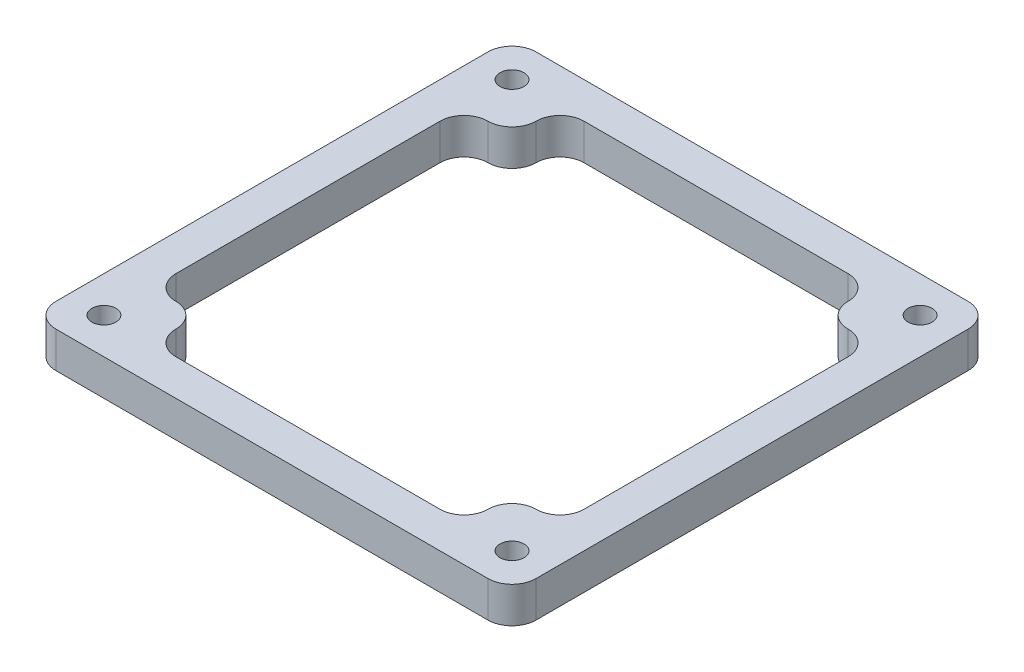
ISO-10303-21;
HEADER;
FILE_DESCRIPTION(('STEP AP214'),'2;1');
FILE_NAME('part.step','',(''),(''),'','','');
FILE_SCHEMA(('AUTOMOTIVE_DESIGN { 1 0 10303 214 1 1 1 1 }'));
ENDSEC;
DATA;
#1=APPLICATION_CONTEXT('core data for automotive mechanical design processes');
#2=APPLICATION_PROTOCOL_DEFINITION('international standard','automotive_design',2000,#1);
#3=PRODUCT_CONTEXT('',#1,'mechanical');
#4=PRODUCT('Part','Part','',(#3));
#5=PRODUCT_RELATED_PRODUCT_CATEGORY('part','',(#4));
#6=PRODUCT_DEFINITION_FORMATION('','',#4);
#7=PRODUCT_DEFINITION_CONTEXT('part definition',#1,'design');
#8=PRODUCT_DEFINITION('design','',#6,#7);
#9=PRODUCT_DEFINITION_SHAPE('','',#8);
#10=(LENGTH_UNIT() NAMED_UNIT(*) SI_UNIT(.MILLI.,.METRE.));
#11=(NAMED_UNIT(*) PLANE_ANGLE_UNIT() SI_UNIT($,.RADIAN.));
#12=(NAMED_UNIT(*) SI_UNIT($,.STERADIAN.) SOLID_ANGLE_UNIT());
#13=UNCERTAINTY_MEASURE_WITH_UNIT(LENGTH_MEASURE(1.E-05),#10,'distance_accuracy_value','');
#14=(GEOMETRIC_REPRESENTATION_CONTEXT(3) GLOBAL_UNCERTAINTY_ASSIGNED_CONTEXT((#13)) GLOBAL_UNIT_ASSIGNED_CONTEXT((#10,
#11,#12)) REPRESENTATION_CONTEXT('',''));
#15=CARTESIAN_POINT('',(0.,0.,0.));
#16=DIRECTION('',(0.,0.,1.));
#17=DIRECTION('',(1.,0.,0.));
#18=AXIS2_PLACEMENT_3D('',#15,#16,#17);
#19=CARTESIAN_POINT('',(0.,3.,0.));
#20=DIRECTION('',(0.,1.,0.));
#21=DIRECTION('',(0.,0.,1.));
#22=AXIS2_PLACEMENT_3D('',#19,#20,#21);
#23=PLANE('',#22);
#24=CARTESIAN_POINT('',(17.,3.,17.));
#25=DIRECTION('',(0.,1.,0.));
#26=DIRECTION('',(0.,0.,1.));
#27=AXIS2_PLACEMENT_3D('',#24,#25,#26);
#28=CIRCLE('',#27,1.);
#29=CARTESIAN_POINT('',(17.,3.,18.));
#30=VERTEX_POINT('',#29);
#31=EDGE_CURVE('E747',#30,#30,#28,.T.);
#32=ORIENTED_EDGE('',*,*,#31,.F.);
#33=EDGE_LOOP('',(#32));
#34=FACE_BOUND('',#33,.T.);
#35=CARTESIAN_POINT('',(-17.,3.,-17.));
#36=DIRECTION('',(0.,1.,0.));
#37=DIRECTION('',(0.,0.,1.));
#38=AXIS2_PLACEMENT_3D('',#35,#36,#37);
#39=CIRCLE('',#38,1.);
#40=CARTESIAN_POINT('',(-17.,3.,-16.));
#41=VERTEX_POINT('',#40);
#42=EDGE_CURVE('E220',#41,#41,#39,.T.);
#43=ORIENTED_EDGE('',*,*,#42,.F.);
#44=EDGE_LOOP('',(#43));
#45=FACE_BOUND('',#44,.T.);
#46=DIRECTION('',(-1.,0.,0.));
#47=VECTOR('',#46,1.);
#48=CARTESIAN_POINT('',(20.,3.,-20.));
#49=LINE('',#48,#47);
#50=CARTESIAN_POINT('',(18.,3.,-20.));
#51=VERTEX_POINT('',#50);
#52=CARTESIAN_POINT('',(-18.,3.,-20.));
#53=VERTEX_POINT('',#52);
#54=EDGE_CURVE('E227',#51,#53,#49,.T.);
#55=ORIENTED_EDGE('',*,*,#54,.T.);
#56=CARTESIAN_POINT('',(-18.,3.,-18.));
#57=DIRECTION('',(0.,1.,0.));
#58=DIRECTION('',(0.,0.,1.));
#59=AXIS2_PLACEMENT_3D('',#56,#57,#58);
#60=CIRCLE('',#59,2.);
#61=CARTESIAN_POINT('',(-20.,3.,-18.));
#62=VERTEX_POINT('',#61);
#63=EDGE_CURVE('E249',#53,#62,#60,.T.);
#64=ORIENTED_EDGE('',*,*,#63,.T.);
#65=DIRECTION('',(0.,0.,1.));
#66=VECTOR('',#65,1.);
#67=CARTESIAN_POINT('',(-20.,3.,20.));
#68=LINE('',#67,#66);
#69=CARTESIAN_POINT('',(-20.,3.,18.));
#70=VERTEX_POINT('',#69);
#71=EDGE_CURVE('E367',#62,#70,#68,.T.);
#72=ORIENTED_EDGE('',*,*,#71,.T.);
#73=CARTESIAN_POINT('',(-18.,3.,18.));
#74=DIRECTION('',(0.,1.,0.));
#75=DIRECTION('',(0.,0.,1.));
#76=AXIS2_PLACEMENT_3D('',#73,#74,#75);
#77=CIRCLE('',#76,2.);
#78=CARTESIAN_POINT('',(-18.,3.,20.));
#79=VERTEX_POINT('',#78);
#80=EDGE_CURVE('E245',#70,#79,#77,.T.);
#81=ORIENTED_EDGE('',*,*,#80,.T.);
#82=DIRECTION('',(1.,0.,0.));
#83=VECTOR('',#82,1.);
#84=CARTESIAN_POINT('',(-20.,3.,20.));
#85=LINE('',#84,#83);
#86=CARTESIAN_POINT('',(18.,3.,20.));
#87=VERTEX_POINT('',#86);
#88=EDGE_CURVE('E370',#79,#87,#85,.T.);
#89=ORIENTED_EDGE('',*,*,#88,.T.);
#90=CARTESIAN_POINT('',(18.,3.,18.));
#91=DIRECTION('',(0.,1.,0.));
#92=DIRECTION('',(0.,0.,1.));
#93=AXIS2_PLACEMENT_3D('',#90,#91,#92);
#94=CIRCLE('',#93,2.);
#95=CARTESIAN_POINT('',(20.,3.,18.));
#96=VERTEX_POINT('',#95);
#97=EDGE_CURVE('E247',#87,#96,#94,.T.);
#98=ORIENTED_EDGE('',*,*,#97,.T.);
#99=DIRECTION('',(0.,0.,-1.));
#100=VECTOR('',#99,1.);
#101=CARTESIAN_POINT('',(20.,3.,20.));
#102=LINE('',#101,#100);
#103=CARTESIAN_POINT('',(20.,3.,-18.));
#104=VERTEX_POINT('',#103);
#105=EDGE_CURVE('E374',#96,#104,#102,.T.);
#106=ORIENTED_EDGE('',*,*,#105,.T.);
#107=CARTESIAN_POINT('',(18.,3.,-18.));
#108=DIRECTION('',(0.,1.,0.));
#109=DIRECTION('',(0.,0.,1.));
#110=AXIS2_PLACEMENT_3D('',#107,#108,#109);
#111=CIRCLE('',#110,2.);
#112=EDGE_CURVE('E243',#104,#51,#111,.T.);
#113=ORIENTED_EDGE('',*,*,#112,.T.);
#114=EDGE_LOOP('',(#55,#64,#72,#81,#89,#98,#106,#113));
#115=FACE_BOUND('',#114,.T.);
#116=DIRECTION('',(1.,0.,0.));
#117=VECTOR('',#116,1.);
#118=CARTESIAN_POINT('',(13.,3.,17.));
#119=LINE('',#118,#117);
#120=CARTESIAN_POINT('',(-11.,3.,17.));
#121=VERTEX_POINT('',#120);
#122=CARTESIAN_POINT('',(11.,3.,17.));
#123=VERTEX_POINT('',#122);
#124=EDGE_CURVE('E361',#121,#123,#119,.T.);
#125=ORIENTED_EDGE('',*,*,#124,.F.);
#126=CARTESIAN_POINT('',(-11.,3.,15.));
#127=DIRECTION('',(0.,1.,0.));
#128=DIRECTION('',(0.,0.,1.));
#129=AXIS2_PLACEMENT_3D('',#126,#127,#128);
#130=CIRCLE('',#129,2.);
#131=CARTESIAN_POINT('',(-13.,3.,15.));
#132=VERTEX_POINT('',#131);
#133=EDGE_CURVE('E56',#121,#132,#130,.F.);
#134=ORIENTED_EDGE('',*,*,#133,.T.);
#135=CARTESIAN_POINT('',(-15.,3.,15.));
#136=DIRECTION('',(0.,1.,0.));
#137=DIRECTION('',(0.,0.,1.));
#138=AXIS2_PLACEMENT_3D('',#135,#136,#137);
#139=CIRCLE('',#138,2.);
#140=CARTESIAN_POINT('',(-15.,3.,13.));
#141=VERTEX_POINT('',#140);
#142=EDGE_CURVE('E51',#132,#141,#139,.T.);
#143=ORIENTED_EDGE('',*,*,#142,.T.);
#144=CARTESIAN_POINT('',(-15.,3.,11.));
#145=DIRECTION('',(0.,1.,0.));
#146=DIRECTION('',(0.,0.,1.));
#147=AXIS2_PLACEMENT_3D('',#144,#145,#146);
#148=CIRCLE('',#147,2.);
#149=CARTESIAN_POINT('',(-17.,3.,11.));
#150=VERTEX_POINT('',#149);
#151=EDGE_CURVE('E294',#141,#150,#148,.F.);
#152=ORIENTED_EDGE('',*,*,#151,.T.);
#153=DIRECTION('',(0.,0.,1.));
#154=VECTOR('',#153,1.);
#155=CARTESIAN_POINT('',(-17.,3.,13.));
#156=LINE('',#155,#154);
#157=CARTESIAN_POINT('',(-17.,3.,-11.));
#158=VERTEX_POINT('',#157);
#159=EDGE_CURVE('E358',#158,#150,#156,.T.);
#160=ORIENTED_EDGE('',*,*,#159,.F.);
#161=CARTESIAN_POINT('',(-15.,3.,-11.));
#162=DIRECTION('',(0.,1.,0.));
#163=DIRECTION('',(0.,0.,1.));
#164=AXIS2_PLACEMENT_3D('',#161,#162,#163);
#165=CIRCLE('',#164,2.);
#166=CARTESIAN_POINT('',(-15.,3.,-13.));
#167=VERTEX_POINT('',#166);
#168=EDGE_CURVE('E207',#158,#167,#165,.F.);
#169=ORIENTED_EDGE('',*,*,#168,.T.);
#170=CARTESIAN_POINT('',(-15.,3.,-15.));
#171=DIRECTION('',(0.,1.,0.));
#172=DIRECTION('',(0.,0.,1.));
#173=AXIS2_PLACEMENT_3D('',#170,#171,#172);
#174=CIRCLE('',#173,2.);
#175=CARTESIAN_POINT('',(-13.,3.,-15.));
#176=VERTEX_POINT('',#175);
#177=EDGE_CURVE('E251',#167,#176,#174,.T.);
#178=ORIENTED_EDGE('',*,*,#177,.T.);
#179=CARTESIAN_POINT('',(-11.,3.,-15.));
#180=DIRECTION('',(0.,1.,0.));
#181=DIRECTION('',(0.,0.,1.));
#182=AXIS2_PLACEMENT_3D('',#179,#180,#181);
#183=CIRCLE('',#182,2.);
#184=CARTESIAN_POINT('',(-11.,3.,-17.));
#185=VERTEX_POINT('',#184);
#186=EDGE_CURVE('E11',#176,#185,#183,.F.);
#187=ORIENTED_EDGE('',*,*,#186,.T.);
#188=DIRECTION('',(-1.,0.,0.));
#189=VECTOR('',#188,1.);
#190=CARTESIAN_POINT('',(13.,3.,-17.));
#191=LINE('',#190,#189);
#192=CARTESIAN_POINT('',(11.,3.,-17.));
#193=VERTEX_POINT('',#192);
#194=EDGE_CURVE('E383',#193,#185,#191,.T.);
#195=ORIENTED_EDGE('',*,*,#194,.F.);
#196=CARTESIAN_POINT('',(11.,3.,-15.));
#197=DIRECTION('',(0.,1.,0.));
#198=DIRECTION('',(0.,0.,1.));
#199=AXIS2_PLACEMENT_3D('',#196,#197,#198);
#200=CIRCLE('',#199,2.);
#201=CARTESIAN_POINT('',(13.,3.,-15.));
#202=VERTEX_POINT('',#201);
#203=EDGE_CURVE('E313',#193,#202,#200,.F.);
#204=ORIENTED_EDGE('',*,*,#203,.T.);
#205=CARTESIAN_POINT('',(15.,3.,-15.));
#206=DIRECTION('',(0.,1.,0.));
#207=DIRECTION('',(0.,0.,1.));
#208=AXIS2_PLACEMENT_3D('',#205,#206,#207);
#209=CIRCLE('',#208,2.);
#210=CARTESIAN_POINT('',(15.,3.,-13.));
#211=VERTEX_POINT('',#210);
#212=EDGE_CURVE('E253',#202,#211,#209,.T.);
#213=ORIENTED_EDGE('',*,*,#212,.T.);
#214=CARTESIAN_POINT('',(15.,3.,-11.));
#215=DIRECTION('',(0.,1.,0.));
#216=DIRECTION('',(0.,0.,1.));
#217=AXIS2_PLACEMENT_3D('',#214,#215,#216);
#218=CIRCLE('',#217,2.);
#219=CARTESIAN_POINT('',(17.,3.,-11.));
#220=VERTEX_POINT('',#219);
#221=EDGE_CURVE('E309',#211,#220,#218,.F.);
#222=ORIENTED_EDGE('',*,*,#221,.T.);
#223=DIRECTION('',(0.,0.,-1.));
#224=VECTOR('',#223,1.);
#225=CARTESIAN_POINT('',(17.,3.,13.));
#226=LINE('',#225,#224);
#227=CARTESIAN_POINT('',(17.,3.,11.));
#228=VERTEX_POINT('',#227);
#229=EDGE_CURVE('E715',#228,#220,#226,.T.);
#230=ORIENTED_EDGE('',*,*,#229,.F.);
#231=CARTESIAN_POINT('',(15.,3.,11.));
#232=DIRECTION('',(0.,1.,0.));
#233=DIRECTION('',(0.,0.,1.));
#234=AXIS2_PLACEMENT_3D('',#231,#232,#233);
#235=CIRCLE('',#234,2.);
#236=CARTESIAN_POINT('',(15.,3.,13.));
#237=VERTEX_POINT('',#236);
#238=EDGE_CURVE('E305',#228,#237,#235,.F.);
#239=ORIENTED_EDGE('',*,*,#238,.T.);
#240=CARTESIAN_POINT('',(15.,3.,15.));
#241=DIRECTION('',(0.,1.,0.));
#242=DIRECTION('',(0.,0.,1.));
#243=AXIS2_PLACEMENT_3D('',#240,#241,#242);
#244=CIRCLE('',#243,2.);
#245=CARTESIAN_POINT('',(13.,3.,15.));
#246=VERTEX_POINT('',#245);
#247=EDGE_CURVE('E255',#237,#246,#244,.T.);
#248=ORIENTED_EDGE('',*,*,#247,.T.);
#249=CARTESIAN_POINT('',(11.,3.,15.));
#250=DIRECTION('',(0.,1.,0.));
#251=DIRECTION('',(0.,0.,1.));
#252=AXIS2_PLACEMENT_3D('',#249,#250,#251);
#253=CIRCLE('',#252,2.);
#254=EDGE_CURVE('E301',#246,#123,#253,.F.);
#255=ORIENTED_EDGE('',*,*,#254,.T.);
#256=EDGE_LOOP('',(#125,#134,#143,#152,#160,#169,#178,#187,#195,#204,#213,#222,#230,#239,#248,#255));
#257=FACE_BOUND('',#256,.T.);
#258=CARTESIAN_POINT('',(17.,3.,-17.));
#259=DIRECTION('',(0.,1.,0.));
#260=DIRECTION('',(0.,0.,1.));
#261=AXIS2_PLACEMENT_3D('',#258,#259,#260);
#262=CIRCLE('',#261,1.);
#263=CARTESIAN_POINT('',(17.,3.,-16.));
#264=VERTEX_POINT('',#263);
#265=EDGE_CURVE('E705',#264,#264,#262,.T.);
#266=ORIENTED_EDGE('',*,*,#265,.F.);
#267=EDGE_LOOP('',(#266));
#268=FACE_BOUND('',#267,.T.);
#269=CARTESIAN_POINT('',(-17.,3.,17.));
#270=DIRECTION('',(0.,1.,0.));
#271=DIRECTION('',(0.,0.,1.));
#272=AXIS2_PLACEMENT_3D('',#269,#270,#271);
#273=CIRCLE('',#272,1.);
#274=CARTESIAN_POINT('',(-17.,3.,18.));
#275=VERTEX_POINT('',#274);
#276=EDGE_CURVE('E744',#275,#275,#273,.T.);
#277=ORIENTED_EDGE('',*,*,#276,.F.);
#278=EDGE_LOOP('',(#277));
#279=FACE_BOUND('',#278,.T.);
#280=ADVANCED_FACE('F34',(#34,#45,#115,#257,#268,#279),#23,.T.);
#281=CARTESIAN_POINT('',(0.,0.,0.));
#282=DIRECTION('',(0.,1.,0.));
#283=DIRECTION('',(0.,0.,1.));
#284=AXIS2_PLACEMENT_3D('',#281,#282,#283);
#285=PLANE('',#284);
#286=CARTESIAN_POINT('',(17.,0.,17.));
#287=DIRECTION('',(0.,1.,0.));
#288=DIRECTION('',(0.,0.,1.));
#289=AXIS2_PLACEMENT_3D('',#286,#287,#288);
#290=CIRCLE('',#289,1.);
#291=CARTESIAN_POINT('',(17.,0.,18.));
#292=VERTEX_POINT('',#291);
#293=EDGE_CURVE('E745',#292,#292,#290,.T.);
#294=ORIENTED_EDGE('',*,*,#293,.T.);
#295=EDGE_LOOP('',(#294));
#296=FACE_BOUND('',#295,.T.);
#297=CARTESIAN_POINT('',(-17.,0.,-17.));
#298=DIRECTION('',(0.,1.,0.));
#299=DIRECTION('',(0.,0.,1.));
#300=AXIS2_PLACEMENT_3D('',#297,#298,#299);
#301=CIRCLE('',#300,1.);
#302=CARTESIAN_POINT('',(-17.,0.,-16.));
#303=VERTEX_POINT('',#302);
#304=EDGE_CURVE('E704',#303,#303,#301,.T.);
#305=ORIENTED_EDGE('',*,*,#304,.T.);
#306=EDGE_LOOP('',(#305));
#307=FACE_BOUND('',#306,.T.);
#308=DIRECTION('',(0.,0.,1.));
#309=VECTOR('',#308,1.);
#310=CARTESIAN_POINT('',(-20.,0.,20.));
#311=LINE('',#310,#309);
#312=CARTESIAN_POINT('',(-20.,0.,-18.));
#313=VERTEX_POINT('',#312);
#314=CARTESIAN_POINT('',(-20.,0.,18.));
#315=VERTEX_POINT('',#314);
#316=EDGE_CURVE('E379',#313,#315,#311,.T.);
#317=ORIENTED_EDGE('',*,*,#316,.F.);
#318=CARTESIAN_POINT('',(-18.,0.,-18.));
#319=DIRECTION('',(0.,1.,0.));
#320=DIRECTION('',(0.,0.,1.));
#321=AXIS2_PLACEMENT_3D('',#318,#319,#320);
#322=CIRCLE('',#321,2.);
#323=CARTESIAN_POINT('',(-18.,0.,-20.));
#324=VERTEX_POINT('',#323);
#325=EDGE_CURVE('E234',#313,#324,#322,.F.);
#326=ORIENTED_EDGE('',*,*,#325,.T.);
#327=DIRECTION('',(-1.,0.,0.));
#328=VECTOR('',#327,1.);
#329=CARTESIAN_POINT('',(20.,0.,-20.));
#330=LINE('',#329,#328);
#331=CARTESIAN_POINT('',(18.,0.,-20.));
#332=VERTEX_POINT('',#331);
#333=EDGE_CURVE('E371',#332,#324,#330,.T.);
#334=ORIENTED_EDGE('',*,*,#333,.F.);
#335=CARTESIAN_POINT('',(18.,0.,-18.));
#336=DIRECTION('',(0.,1.,0.));
#337=DIRECTION('',(0.,0.,1.));
#338=AXIS2_PLACEMENT_3D('',#335,#336,#337);
#339=CIRCLE('',#338,2.);
#340=CARTESIAN_POINT('',(20.,0.,-18.));
#341=VERTEX_POINT('',#340);
#342=EDGE_CURVE('E223',#332,#341,#339,.F.);
#343=ORIENTED_EDGE('',*,*,#342,.T.);
#344=DIRECTION('',(0.,0.,-1.));
#345=VECTOR('',#344,1.);
#346=CARTESIAN_POINT('',(20.,0.,20.));
#347=LINE('',#346,#345);
#348=CARTESIAN_POINT('',(20.,0.,18.));
#349=VERTEX_POINT('',#348);
#350=EDGE_CURVE('E386',#349,#341,#347,.T.);
#351=ORIENTED_EDGE('',*,*,#350,.F.);
#352=CARTESIAN_POINT('',(18.,0.,18.));
#353=DIRECTION('',(0.,1.,0.));
#354=DIRECTION('',(0.,0.,1.));
#355=AXIS2_PLACEMENT_3D('',#352,#353,#354);
#356=CIRCLE('',#355,2.);
#357=CARTESIAN_POINT('',(18.,0.,20.));
#358=VERTEX_POINT('',#357);
#359=EDGE_CURVE('E232',#349,#358,#356,.F.);
#360=ORIENTED_EDGE('',*,*,#359,.T.);
#361=DIRECTION('',(1.,0.,0.));
#362=VECTOR('',#361,1.);
#363=CARTESIAN_POINT('',(-20.,0.,20.));
#364=LINE('',#363,#362);
#365=CARTESIAN_POINT('',(-18.,0.,20.));
#366=VERTEX_POINT('',#365);
#367=EDGE_CURVE('E382',#366,#358,#364,.T.);
#368=ORIENTED_EDGE('',*,*,#367,.F.);
#369=CARTESIAN_POINT('',(-18.,0.,18.));
#370=DIRECTION('',(0.,1.,0.));
#371=DIRECTION('',(0.,0.,1.));
#372=AXIS2_PLACEMENT_3D('',#369,#370,#371);
#373=CIRCLE('',#372,2.);
#374=EDGE_CURVE('E225',#366,#315,#373,.F.);
#375=ORIENTED_EDGE('',*,*,#374,.T.);
#376=EDGE_LOOP('',(#317,#326,#334,#343,#351,#360,#368,#375));
#377=FACE_BOUND('',#376,.T.);
#378=DIRECTION('',(0.,0.,1.));
#379=VECTOR('',#378,1.);
#380=CARTESIAN_POINT('',(-17.,0.,13.));
#381=LINE('',#380,#379);
#382=CARTESIAN_POINT('',(-17.,0.,-11.));
#383=VERTEX_POINT('',#382);
#384=CARTESIAN_POINT('',(-17.,0.,11.));
#385=VERTEX_POINT('',#384);
#386=EDGE_CURVE('E200',#383,#385,#381,.T.);
#387=ORIENTED_EDGE('',*,*,#386,.T.);
#388=CARTESIAN_POINT('',(-15.,0.,11.));
#389=DIRECTION('',(0.,1.,0.));
#390=DIRECTION('',(0.,0.,1.));
#391=AXIS2_PLACEMENT_3D('',#388,#389,#390);
#392=CIRCLE('',#391,2.);
#393=CARTESIAN_POINT('',(-15.,0.,13.));
#394=VERTEX_POINT('',#393);
#395=EDGE_CURVE('E292',#385,#394,#392,.T.);
#396=ORIENTED_EDGE('',*,*,#395,.T.);
#397=CARTESIAN_POINT('',(-15.,0.,15.));
#398=DIRECTION('',(0.,1.,0.));
#399=DIRECTION('',(0.,0.,1.));
#400=AXIS2_PLACEMENT_3D('',#397,#398,#399);
#401=CIRCLE('',#400,2.);
#402=CARTESIAN_POINT('',(-13.,0.,15.));
#403=VERTEX_POINT('',#402);
#404=EDGE_CURVE('E241',#394,#403,#401,.F.);
#405=ORIENTED_EDGE('',*,*,#404,.T.);
#406=CARTESIAN_POINT('',(-11.,0.,15.));
#407=DIRECTION('',(0.,1.,0.));
#408=DIRECTION('',(0.,0.,1.));
#409=AXIS2_PLACEMENT_3D('',#406,#407,#408);
#410=CIRCLE('',#409,2.);
#411=CARTESIAN_POINT('',(-11.,0.,17.));
#412=VERTEX_POINT('',#411);
#413=EDGE_CURVE('E296',#403,#412,#410,.T.);
#414=ORIENTED_EDGE('',*,*,#413,.T.);
#415=DIRECTION('',(1.,0.,0.));
#416=VECTOR('',#415,1.);
#417=CARTESIAN_POINT('',(13.,0.,17.));
#418=LINE('',#417,#416);
#419=CARTESIAN_POINT('',(11.,0.,17.));
#420=VERTEX_POINT('',#419);
#421=EDGE_CURVE('E219',#412,#420,#418,.T.);
#422=ORIENTED_EDGE('',*,*,#421,.T.);
#423=CARTESIAN_POINT('',(11.,0.,15.));
#424=DIRECTION('',(0.,1.,0.));
#425=DIRECTION('',(0.,0.,1.));
#426=AXIS2_PLACEMENT_3D('',#423,#424,#425);
#427=CIRCLE('',#426,2.);
#428=CARTESIAN_POINT('',(13.,0.,15.));
#429=VERTEX_POINT('',#428);
#430=EDGE_CURVE('E299',#420,#429,#427,.T.);
#431=ORIENTED_EDGE('',*,*,#430,.T.);
#432=CARTESIAN_POINT('',(15.,0.,15.));
#433=DIRECTION('',(0.,1.,0.));
#434=DIRECTION('',(0.,0.,1.));
#435=AXIS2_PLACEMENT_3D('',#432,#433,#434);
#436=CIRCLE('',#435,2.);
#437=CARTESIAN_POINT('',(15.,0.,13.));
#438=VERTEX_POINT('',#437);
#439=EDGE_CURVE('E239',#429,#438,#436,.F.);
#440=ORIENTED_EDGE('',*,*,#439,.T.);
#441=CARTESIAN_POINT('',(15.,0.,11.));
#442=DIRECTION('',(0.,1.,0.));
#443=DIRECTION('',(0.,0.,1.));
#444=AXIS2_PLACEMENT_3D('',#441,#442,#443);
#445=CIRCLE('',#444,2.);
#446=CARTESIAN_POINT('',(17.,0.,11.));
#447=VERTEX_POINT('',#446);
#448=EDGE_CURVE('E303',#438,#447,#445,.T.);
#449=ORIENTED_EDGE('',*,*,#448,.T.);
#450=DIRECTION('',(0.,0.,-1.));
#451=VECTOR('',#450,1.);
#452=CARTESIAN_POINT('',(17.,0.,13.));
#453=LINE('',#452,#451);
#454=CARTESIAN_POINT('',(17.,0.,-11.));
#455=VERTEX_POINT('',#454);
#456=EDGE_CURVE('E359',#447,#455,#453,.T.);
#457=ORIENTED_EDGE('',*,*,#456,.T.);
#458=CARTESIAN_POINT('',(15.,0.,-11.));
#459=DIRECTION('',(0.,1.,0.));
#460=DIRECTION('',(0.,0.,1.));
#461=AXIS2_PLACEMENT_3D('',#458,#459,#460);
#462=CIRCLE('',#461,2.);
#463=CARTESIAN_POINT('',(15.,0.,-13.));
#464=VERTEX_POINT('',#463);
#465=EDGE_CURVE('E307',#455,#464,#462,.T.);
#466=ORIENTED_EDGE('',*,*,#465,.T.);
#467=CARTESIAN_POINT('',(15.,0.,-15.));
#468=DIRECTION('',(0.,1.,0.));
#469=DIRECTION('',(0.,0.,1.));
#470=AXIS2_PLACEMENT_3D('',#467,#468,#469);
#471=CIRCLE('',#470,2.);
#472=CARTESIAN_POINT('',(13.,0.,-15.));
#473=VERTEX_POINT('',#472);
#474=EDGE_CURVE('E237',#464,#473,#471,.F.);
#475=ORIENTED_EDGE('',*,*,#474,.T.);
#476=CARTESIAN_POINT('',(11.,0.,-15.));
#477=DIRECTION('',(0.,1.,0.));
#478=DIRECTION('',(0.,0.,1.));
#479=AXIS2_PLACEMENT_3D('',#476,#477,#478);
#480=CIRCLE('',#479,2.);
#481=CARTESIAN_POINT('',(11.,0.,-17.));
#482=VERTEX_POINT('',#481);
#483=EDGE_CURVE('E311',#473,#482,#480,.T.);
#484=ORIENTED_EDGE('',*,*,#483,.T.);
#485=DIRECTION('',(-1.,0.,0.));
#486=VECTOR('',#485,1.);
#487=CARTESIAN_POINT('',(13.,0.,-17.));
#488=LINE('',#487,#486);
#489=CARTESIAN_POINT('',(-11.,0.,-17.));
#490=VERTEX_POINT('',#489);
#491=EDGE_CURVE('E351',#482,#490,#488,.T.);
#492=ORIENTED_EDGE('',*,*,#491,.T.);
#493=CARTESIAN_POINT('',(-11.,0.,-15.));
#494=DIRECTION('',(0.,1.,0.));
#495=DIRECTION('',(0.,0.,1.));
#496=AXIS2_PLACEMENT_3D('',#493,#494,#495);
#497=CIRCLE('',#496,2.);
#498=CARTESIAN_POINT('',(-13.,0.,-15.));
#499=VERTEX_POINT('',#498);
#500=EDGE_CURVE('E43',#490,#499,#497,.T.);
#501=ORIENTED_EDGE('',*,*,#500,.T.);
#502=CARTESIAN_POINT('',(-15.,0.,-15.));
#503=DIRECTION('',(0.,1.,0.));
#504=DIRECTION('',(0.,0.,1.));
#505=AXIS2_PLACEMENT_3D('',#502,#503,#504);
#506=CIRCLE('',#505,2.);
#507=CARTESIAN_POINT('',(-15.,0.,-13.));
#508=VERTEX_POINT('',#507);
#509=EDGE_CURVE('E202',#499,#508,#506,.F.);
#510=ORIENTED_EDGE('',*,*,#509,.T.);
#511=CARTESIAN_POINT('',(-15.,0.,-11.));
#512=DIRECTION('',(0.,1.,0.));
#513=DIRECTION('',(0.,0.,1.));
#514=AXIS2_PLACEMENT_3D('',#511,#512,#513);
#515=CIRCLE('',#514,2.);
#516=EDGE_CURVE('E196',#508,#383,#515,.T.);
#517=ORIENTED_EDGE('',*,*,#516,.T.);
#518=EDGE_LOOP('',(#387,#396,#405,#414,#422,#431,#440,#449,#457,#466,#475,#484,#492,#501,#510,#517));
#519=FACE_BOUND('',#518,.T.);
#520=CARTESIAN_POINT('',(17.,0.,-17.));
#521=DIRECTION('',(0.,1.,0.));
#522=DIRECTION('',(0.,0.,1.));
#523=AXIS2_PLACEMENT_3D('',#520,#521,#522);
#524=CIRCLE('',#523,1.);
#525=CARTESIAN_POINT('',(17.,0.,-16.));
#526=VERTEX_POINT('',#525);
#527=EDGE_CURVE('E709',#526,#526,#524,.T.);
#528=ORIENTED_EDGE('',*,*,#527,.T.);
#529=EDGE_LOOP('',(#528));
#530=FACE_BOUND('',#529,.T.);
#531=CARTESIAN_POINT('',(-17.,0.,17.));
#532=DIRECTION('',(0.,1.,0.));
#533=DIRECTION('',(0.,0.,1.));
#534=AXIS2_PLACEMENT_3D('',#531,#532,#533);
#535=CIRCLE('',#534,1.);
#536=CARTESIAN_POINT('',(-17.,0.,18.));
#537=VERTEX_POINT('',#536);
#538=EDGE_CURVE('E322',#537,#537,#535,.T.);
#539=ORIENTED_EDGE('',*,*,#538,.T.);
#540=EDGE_LOOP('',(#539));
#541=FACE_BOUND('',#540,.T.);
#542=ADVANCED_FACE('F198',(#296,#307,#377,#519,#530,#541),#285,.F.);
#543=CARTESIAN_POINT('',(-20.,3.,20.));
#544=DIRECTION('',(1.,0.,0.));
#545=DIRECTION('',(0.,0.,-1.));
#546=AXIS2_PLACEMENT_3D('',#543,#544,#545);
#547=PLANE('',#546);
#548=ORIENTED_EDGE('',*,*,#71,.F.);
#549=DIRECTION('',(0.,-1.,0.));
#550=VECTOR('',#549,1.);
#551=CARTESIAN_POINT('',(-20.,3.,-18.));
#552=LINE('',#551,#550);
#553=EDGE_CURVE('E274',#62,#313,#552,.T.);
#554=ORIENTED_EDGE('',*,*,#553,.T.);
#555=ORIENTED_EDGE('',*,*,#316,.T.);
#556=DIRECTION('',(0.,-1.,0.));
#557=VECTOR('',#556,1.);
#558=CARTESIAN_POINT('',(-20.,3.,18.));
#559=LINE('',#558,#557);
#560=EDGE_CURVE('E272',#315,#70,#559,.F.);
#561=ORIENTED_EDGE('',*,*,#560,.T.);
#562=EDGE_LOOP('',(#548,#554,#555,#561));
#563=FACE_BOUND('',#562,.T.);
#564=ADVANCED_FACE('F404',(#563),#547,.F.);
#565=CARTESIAN_POINT('',(-20.,3.,20.));
#566=DIRECTION('',(0.,0.,-1.));
#567=DIRECTION('',(-1.,0.,0.));
#568=AXIS2_PLACEMENT_3D('',#565,#566,#567);
#569=PLANE('',#568);
#570=ORIENTED_EDGE('',*,*,#367,.T.);
#571=DIRECTION('',(0.,-1.,0.));
#572=VECTOR('',#571,1.);
#573=CARTESIAN_POINT('',(18.,3.,20.));
#574=LINE('',#573,#572);
#575=EDGE_CURVE('E208',#358,#87,#574,.F.);
#576=ORIENTED_EDGE('',*,*,#575,.T.);
#577=ORIENTED_EDGE('',*,*,#88,.F.);
#578=DIRECTION('',(0.,-1.,0.));
#579=VECTOR('',#578,1.);
#580=CARTESIAN_POINT('',(-18.,3.,20.));
#581=LINE('',#580,#579);
#582=EDGE_CURVE('E287',#79,#366,#581,.T.);
#583=ORIENTED_EDGE('',*,*,#582,.T.);
#584=EDGE_LOOP('',(#570,#576,#577,#583));
#585=FACE_BOUND('',#584,.T.);
#586=ADVANCED_FACE('F413',(#585),#569,.F.);
#587=CARTESIAN_POINT('',(20.,3.,20.));
#588=DIRECTION('',(-1.,0.,0.));
#589=DIRECTION('',(0.,0.,1.));
#590=AXIS2_PLACEMENT_3D('',#587,#588,#589);
#591=PLANE('',#590);
#592=ORIENTED_EDGE('',*,*,#105,.F.);
#593=DIRECTION('',(0.,-1.,0.));
#594=VECTOR('',#593,1.);
#595=CARTESIAN_POINT('',(20.,3.,18.));
#596=LINE('',#595,#594);
#597=EDGE_CURVE('E284',#96,#349,#596,.T.);
#598=ORIENTED_EDGE('',*,*,#597,.T.);
#599=ORIENTED_EDGE('',*,*,#350,.T.);
#600=DIRECTION('',(0.,-1.,0.));
#601=VECTOR('',#600,1.);
#602=CARTESIAN_POINT('',(20.,3.,-18.));
#603=LINE('',#602,#601);
#604=EDGE_CURVE('E282',#341,#104,#603,.F.);
#605=ORIENTED_EDGE('',*,*,#604,.T.);
#606=EDGE_LOOP('',(#592,#598,#599,#605));
#607=FACE_BOUND('',#606,.T.);
#608=ADVANCED_FACE('F422',(#607),#591,.F.);
#609=CARTESIAN_POINT('',(20.,3.,-20.));
#610=DIRECTION('',(0.,0.,1.));
#611=DIRECTION('',(1.,0.,0.));
#612=AXIS2_PLACEMENT_3D('',#609,#610,#611);
#613=PLANE('',#612);
#614=ORIENTED_EDGE('',*,*,#333,.T.);
#615=DIRECTION('',(0.,-1.,0.));
#616=VECTOR('',#615,1.);
#617=CARTESIAN_POINT('',(-18.,3.,-20.));
#618=LINE('',#617,#616);
#619=EDGE_CURVE('E280',#324,#53,#618,.F.);
#620=ORIENTED_EDGE('',*,*,#619,.T.);
#621=ORIENTED_EDGE('',*,*,#54,.F.);
#622=DIRECTION('',(0.,-1.,0.));
#623=VECTOR('',#622,1.);
#624=CARTESIAN_POINT('',(18.,3.,-20.));
#625=LINE('',#624,#623);
#626=EDGE_CURVE('E277',#51,#332,#625,.T.);
#627=ORIENTED_EDGE('',*,*,#626,.T.);
#628=EDGE_LOOP('',(#614,#620,#621,#627));
#629=FACE_BOUND('',#628,.T.);
#630=ADVANCED_FACE('F392',(#629),#613,.F.);
#631=CARTESIAN_POINT('',(-17.,3.,13.));
#632=DIRECTION('',(1.,0.,0.));
#633=DIRECTION('',(0.,0.,-1.));
#634=AXIS2_PLACEMENT_3D('',#631,#632,#633);
#635=PLANE('',#634);
#636=ORIENTED_EDGE('',*,*,#386,.F.);
#637=DIRECTION('',(0.,-1.,0.));
#638=VECTOR('',#637,1.);
#639=CARTESIAN_POINT('',(-17.,3.,-11.));
#640=LINE('',#639,#638);
#641=EDGE_CURVE('E215',#383,#158,#640,.F.);
#642=ORIENTED_EDGE('',*,*,#641,.T.);
#643=ORIENTED_EDGE('',*,*,#159,.T.);
#644=DIRECTION('',(0.,-1.,0.));
#645=VECTOR('',#644,1.);
#646=CARTESIAN_POINT('',(-17.,0.,11.));
#647=LINE('',#646,#645);
#648=EDGE_CURVE('E218',#150,#385,#647,.T.);
#649=ORIENTED_EDGE('',*,*,#648,.T.);
#650=EDGE_LOOP('',(#636,#642,#643,#649));
#651=FACE_BOUND('',#650,.T.);
#652=ADVANCED_FACE('F213',(#651),#635,.T.);
#653=CARTESIAN_POINT('',(13.,3.,17.));
#654=DIRECTION('',(0.,0.,-1.));
#655=DIRECTION('',(-1.,0.,0.));
#656=AXIS2_PLACEMENT_3D('',#653,#654,#655);
#657=PLANE('',#656);
#658=ORIENTED_EDGE('',*,*,#421,.F.);
#659=DIRECTION('',(0.,-1.,0.));
#660=VECTOR('',#659,1.);
#661=CARTESIAN_POINT('',(-11.,3.,17.));
#662=LINE('',#661,#660);
#663=EDGE_CURVE('E261',#412,#121,#662,.F.);
#664=ORIENTED_EDGE('',*,*,#663,.T.);
#665=ORIENTED_EDGE('',*,*,#124,.T.);
#666=DIRECTION('',(0.,-1.,0.));
#667=VECTOR('',#666,1.);
#668=CARTESIAN_POINT('',(11.,0.,17.));
#669=LINE('',#668,#667);
#670=EDGE_CURVE('E258',#123,#420,#669,.T.);
#671=ORIENTED_EDGE('',*,*,#670,.T.);
#672=EDGE_LOOP('',(#658,#664,#665,#671));
#673=FACE_BOUND('',#672,.T.);
#674=ADVANCED_FACE('F608',(#673),#657,.T.);
#675=CARTESIAN_POINT('',(17.,3.,13.));
#676=DIRECTION('',(-1.,0.,0.));
#677=DIRECTION('',(0.,0.,1.));
#678=AXIS2_PLACEMENT_3D('',#675,#676,#677);
#679=PLANE('',#678);
#680=ORIENTED_EDGE('',*,*,#456,.F.);
#681=DIRECTION('',(0.,-1.,0.));
#682=VECTOR('',#681,1.);
#683=CARTESIAN_POINT('',(17.,3.,11.));
#684=LINE('',#683,#682);
#685=EDGE_CURVE('E266',#447,#228,#684,.F.);
#686=ORIENTED_EDGE('',*,*,#685,.T.);
#687=ORIENTED_EDGE('',*,*,#229,.T.);
#688=DIRECTION('',(0.,-1.,0.));
#689=VECTOR('',#688,1.);
#690=CARTESIAN_POINT('',(17.,0.,-11.));
#691=LINE('',#690,#689);
#692=EDGE_CURVE('E263',#220,#455,#691,.T.);
#693=ORIENTED_EDGE('',*,*,#692,.T.);
#694=EDGE_LOOP('',(#680,#686,#687,#693));
#695=FACE_BOUND('',#694,.T.);
#696=ADVANCED_FACE('F597',(#695),#679,.T.);
#697=CARTESIAN_POINT('',(13.,3.,-17.));
#698=DIRECTION('',(0.,0.,1.));
#699=DIRECTION('',(1.,0.,0.));
#700=AXIS2_PLACEMENT_3D('',#697,#698,#699);
#701=PLANE('',#700);
#702=ORIENTED_EDGE('',*,*,#491,.F.);
#703=DIRECTION('',(0.,-1.,0.));
#704=VECTOR('',#703,1.);
#705=CARTESIAN_POINT('',(11.,3.,-17.));
#706=LINE('',#705,#704);
#707=EDGE_CURVE('E270',#482,#193,#706,.F.);
#708=ORIENTED_EDGE('',*,*,#707,.T.);
#709=ORIENTED_EDGE('',*,*,#194,.T.);
#710=DIRECTION('',(0.,-1.,0.));
#711=VECTOR('',#710,1.);
#712=CARTESIAN_POINT('',(-11.,0.,-17.));
#713=LINE('',#712,#711);
#714=EDGE_CURVE('E268',#185,#490,#713,.T.);
#715=ORIENTED_EDGE('',*,*,#714,.T.);
#716=EDGE_LOOP('',(#702,#708,#709,#715));
#717=FACE_BOUND('',#716,.T.);
#718=ADVANCED_FACE('F354',(#717),#701,.T.);
#719=CARTESIAN_POINT('',(-17.,3.,-17.));
#720=DIRECTION('',(0.,-1.,0.));
#721=DIRECTION('',(0.,0.,-1.));
#722=AXIS2_PLACEMENT_3D('',#719,#720,#721);
#723=CYLINDRICAL_SURFACE('',#722,1.);
#724=ORIENTED_EDGE('',*,*,#42,.T.);
#725=EDGE_LOOP('',(#724));
#726=FACE_BOUND('',#725,.T.);
#727=ORIENTED_EDGE('',*,*,#304,.F.);
#728=EDGE_LOOP('',(#727));
#729=FACE_BOUND('',#728,.T.);
#730=ADVANCED_FACE('F596',(#726,#729),#723,.F.);
#731=CARTESIAN_POINT('',(17.,3.,-17.));
#732=DIRECTION('',(0.,-1.,0.));
#733=DIRECTION('',(0.,0.,-1.));
#734=AXIS2_PLACEMENT_3D('',#731,#732,#733);
#735=CYLINDRICAL_SURFACE('',#734,1.);
#736=ORIENTED_EDGE('',*,*,#265,.T.);
#737=EDGE_LOOP('',(#736));
#738=FACE_BOUND('',#737,.T.);
#739=ORIENTED_EDGE('',*,*,#527,.F.);
#740=EDGE_LOOP('',(#739));
#741=FACE_BOUND('',#740,.T.);
#742=ADVANCED_FACE('F678',(#738,#741),#735,.F.);
#743=CARTESIAN_POINT('',(17.,3.,17.));
#744=DIRECTION('',(0.,-1.,0.));
#745=DIRECTION('',(0.,0.,-1.));
#746=AXIS2_PLACEMENT_3D('',#743,#744,#745);
#747=CYLINDRICAL_SURFACE('',#746,1.);
#748=ORIENTED_EDGE('',*,*,#31,.T.);
#749=EDGE_LOOP('',(#748));
#750=FACE_BOUND('',#749,.T.);
#751=ORIENTED_EDGE('',*,*,#293,.F.);
#752=EDGE_LOOP('',(#751));
#753=FACE_BOUND('',#752,.T.);
#754=ADVANCED_FACE('F668',(#750,#753),#747,.F.);
#755=CARTESIAN_POINT('',(-17.,3.,17.));
#756=DIRECTION('',(0.,-1.,0.));
#757=DIRECTION('',(0.,0.,-1.));
#758=AXIS2_PLACEMENT_3D('',#755,#756,#757);
#759=CYLINDRICAL_SURFACE('',#758,1.);
#760=ORIENTED_EDGE('',*,*,#276,.T.);
#761=EDGE_LOOP('',(#760));
#762=FACE_BOUND('',#761,.T.);
#763=ORIENTED_EDGE('',*,*,#538,.F.);
#764=EDGE_LOOP('',(#763));
#765=FACE_BOUND('',#764,.T.);
#766=ADVANCED_FACE('F456',(#762,#765),#759,.F.);
#767=CARTESIAN_POINT('',(-11.,3.,-15.));
#768=DIRECTION('',(0.,1.,0.));
#769=DIRECTION('',(0.,0.,1.));
#770=AXIS2_PLACEMENT_3D('',#767,#768,#769);
#771=CYLINDRICAL_SURFACE('',#770,2.);
#772=ORIENTED_EDGE('',*,*,#714,.F.);
#773=ORIENTED_EDGE('',*,*,#186,.F.);
#774=DIRECTION('',(0.,-1.,0.));
#775=VECTOR('',#774,1.);
#776=CARTESIAN_POINT('',(-13.,3.,-15.));
#777=LINE('',#776,#775);
#778=EDGE_CURVE('E318',#499,#176,#777,.F.);
#779=ORIENTED_EDGE('',*,*,#778,.F.);
#780=ORIENTED_EDGE('',*,*,#500,.F.);
#781=EDGE_LOOP('',(#772,#773,#779,#780));
#782=FACE_BOUND('',#781,.T.);
#783=ADVANCED_FACE('F452',(#782),#771,.F.);
#784=CARTESIAN_POINT('',(-15.,3.,-15.));
#785=DIRECTION('',(0.,-1.,0.));
#786=DIRECTION('',(0.,0.,-1.));
#787=AXIS2_PLACEMENT_3D('',#784,#785,#786);
#788=CYLINDRICAL_SURFACE('',#787,2.);
#789=ORIENTED_EDGE('',*,*,#778,.T.);
#790=ORIENTED_EDGE('',*,*,#177,.F.);
#791=DIRECTION('',(0.,-1.,0.));
#792=VECTOR('',#791,1.);
#793=CARTESIAN_POINT('',(-15.,3.,-13.));
#794=LINE('',#793,#792);
#795=EDGE_CURVE('E316',#508,#167,#794,.F.);
#796=ORIENTED_EDGE('',*,*,#795,.F.);
#797=ORIENTED_EDGE('',*,*,#509,.F.);
#798=EDGE_LOOP('',(#789,#790,#796,#797));
#799=FACE_BOUND('',#798,.T.);
#800=ADVANCED_FACE('F449',(#799),#788,.T.);
#801=CARTESIAN_POINT('',(-15.,3.,-11.));
#802=DIRECTION('',(0.,1.,0.));
#803=DIRECTION('',(0.,0.,1.));
#804=AXIS2_PLACEMENT_3D('',#801,#802,#803);
#805=CYLINDRICAL_SURFACE('',#804,2.);
#806=ORIENTED_EDGE('',*,*,#168,.F.);
#807=ORIENTED_EDGE('',*,*,#641,.F.);
#808=ORIENTED_EDGE('',*,*,#516,.F.);
#809=ORIENTED_EDGE('',*,*,#795,.T.);
#810=EDGE_LOOP('',(#806,#807,#808,#809));
#811=FACE_BOUND('',#810,.T.);
#812=ADVANCED_FACE('F222',(#811),#805,.F.);
#813=CARTESIAN_POINT('',(-11.,3.,15.));
#814=DIRECTION('',(0.,1.,0.));
#815=DIRECTION('',(0.,0.,1.));
#816=AXIS2_PLACEMENT_3D('',#813,#814,#815);
#817=CYLINDRICAL_SURFACE('',#816,2.);
#818=ORIENTED_EDGE('',*,*,#663,.F.);
#819=ORIENTED_EDGE('',*,*,#413,.F.);
#820=DIRECTION('',(0.,-1.,0.));
#821=VECTOR('',#820,1.);
#822=CARTESIAN_POINT('',(-13.,0.,15.));
#823=LINE('',#822,#821);
#824=EDGE_CURVE('E319',#132,#403,#823,.T.);
#825=ORIENTED_EDGE('',*,*,#824,.F.);
#826=ORIENTED_EDGE('',*,*,#133,.F.);
#827=EDGE_LOOP('',(#818,#819,#825,#826));
#828=FACE_BOUND('',#827,.T.);
#829=ADVANCED_FACE('F448',(#828),#817,.F.);
#830=CARTESIAN_POINT('',(-15.,3.,15.));
#831=DIRECTION('',(0.,-1.,0.));
#832=DIRECTION('',(0.,0.,-1.));
#833=AXIS2_PLACEMENT_3D('',#830,#831,#832);
#834=CYLINDRICAL_SURFACE('',#833,2.);
#835=DIRECTION('',(0.,-1.,0.));
#836=VECTOR('',#835,1.);
#837=CARTESIAN_POINT('',(-15.,3.,13.));
#838=LINE('',#837,#836);
#839=EDGE_CURVE('E323',#141,#394,#838,.T.);
#840=ORIENTED_EDGE('',*,*,#839,.F.);
#841=ORIENTED_EDGE('',*,*,#142,.F.);
#842=ORIENTED_EDGE('',*,*,#824,.T.);
#843=ORIENTED_EDGE('',*,*,#404,.F.);
#844=EDGE_LOOP('',(#840,#841,#842,#843));
#845=FACE_BOUND('',#844,.T.);
#846=ADVANCED_FACE('F462',(#845),#834,.T.);
#847=CARTESIAN_POINT('',(-15.,3.,11.));
#848=DIRECTION('',(0.,1.,0.));
#849=DIRECTION('',(0.,0.,1.));
#850=AXIS2_PLACEMENT_3D('',#847,#848,#849);
#851=CYLINDRICAL_SURFACE('',#850,2.);
#852=ORIENTED_EDGE('',*,*,#151,.F.);
#853=ORIENTED_EDGE('',*,*,#839,.T.);
#854=ORIENTED_EDGE('',*,*,#395,.F.);
#855=ORIENTED_EDGE('',*,*,#648,.F.);
#856=EDGE_LOOP('',(#852,#853,#854,#855));
#857=FACE_BOUND('',#856,.T.);
#858=ADVANCED_FACE('F458',(#857),#851,.F.);
#859=CARTESIAN_POINT('',(15.,3.,11.));
#860=DIRECTION('',(0.,1.,0.));
#861=DIRECTION('',(0.,0.,1.));
#862=AXIS2_PLACEMENT_3D('',#859,#860,#861);
#863=CYLINDRICAL_SURFACE('',#862,2.);
#864=ORIENTED_EDGE('',*,*,#685,.F.);
#865=ORIENTED_EDGE('',*,*,#448,.F.);
#866=DIRECTION('',(0.,-1.,0.));
#867=VECTOR('',#866,1.);
#868=CARTESIAN_POINT('',(15.,0.,13.));
#869=LINE('',#868,#867);
#870=EDGE_CURVE('E326',#237,#438,#869,.T.);
#871=ORIENTED_EDGE('',*,*,#870,.F.);
#872=ORIENTED_EDGE('',*,*,#238,.F.);
#873=EDGE_LOOP('',(#864,#865,#871,#872));
#874=FACE_BOUND('',#873,.T.);
#875=ADVANCED_FACE('F461',(#874),#863,.F.);
#876=CARTESIAN_POINT('',(15.,3.,15.));
#877=DIRECTION('',(0.,-1.,0.));
#878=DIRECTION('',(0.,0.,-1.));
#879=AXIS2_PLACEMENT_3D('',#876,#877,#878);
#880=CYLINDRICAL_SURFACE('',#879,2.);
#881=DIRECTION('',(0.,-1.,0.));
#882=VECTOR('',#881,1.);
#883=CARTESIAN_POINT('',(13.,3.,15.));
#884=LINE('',#883,#882);
#885=EDGE_CURVE('E329',#246,#429,#884,.T.);
#886=ORIENTED_EDGE('',*,*,#885,.F.);
#887=ORIENTED_EDGE('',*,*,#247,.F.);
#888=ORIENTED_EDGE('',*,*,#870,.T.);
#889=ORIENTED_EDGE('',*,*,#439,.F.);
#890=EDGE_LOOP('',(#886,#887,#888,#889));
#891=FACE_BOUND('',#890,.T.);
#892=ADVANCED_FACE('F473',(#891),#880,.T.);
#893=CARTESIAN_POINT('',(11.,3.,15.));
#894=DIRECTION('',(0.,1.,0.));
#895=DIRECTION('',(0.,0.,1.));
#896=AXIS2_PLACEMENT_3D('',#893,#894,#895);
#897=CYLINDRICAL_SURFACE('',#896,2.);
#898=ORIENTED_EDGE('',*,*,#254,.F.);
#899=ORIENTED_EDGE('',*,*,#885,.T.);
#900=ORIENTED_EDGE('',*,*,#430,.F.);
#901=ORIENTED_EDGE('',*,*,#670,.F.);
#902=EDGE_LOOP('',(#898,#899,#900,#901));
#903=FACE_BOUND('',#902,.T.);
#904=ADVANCED_FACE('F470',(#903),#897,.F.);
#905=CARTESIAN_POINT('',(11.,3.,-15.));
#906=DIRECTION('',(0.,1.,0.));
#907=DIRECTION('',(0.,0.,1.));
#908=AXIS2_PLACEMENT_3D('',#905,#906,#907);
#909=CYLINDRICAL_SURFACE('',#908,2.);
#910=ORIENTED_EDGE('',*,*,#707,.F.);
#911=ORIENTED_EDGE('',*,*,#483,.F.);
#912=DIRECTION('',(0.,-1.,0.));
#913=VECTOR('',#912,1.);
#914=CARTESIAN_POINT('',(13.,0.,-15.));
#915=LINE('',#914,#913);
#916=EDGE_CURVE('E38',#202,#473,#915,.T.);
#917=ORIENTED_EDGE('',*,*,#916,.F.);
#918=ORIENTED_EDGE('',*,*,#203,.F.);
#919=EDGE_LOOP('',(#910,#911,#917,#918));
#920=FACE_BOUND('',#919,.T.);
#921=ADVANCED_FACE('F348',(#920),#909,.F.);
#922=CARTESIAN_POINT('',(15.,3.,-15.));
#923=DIRECTION('',(0.,-1.,0.));
#924=DIRECTION('',(0.,0.,-1.));
#925=AXIS2_PLACEMENT_3D('',#922,#923,#924);
#926=CYLINDRICAL_SURFACE('',#925,2.);
#927=DIRECTION('',(0.,-1.,0.));
#928=VECTOR('',#927,1.);
#929=CARTESIAN_POINT('',(15.,3.,-13.));
#930=LINE('',#929,#928);
#931=EDGE_CURVE('E333',#211,#464,#930,.T.);
#932=ORIENTED_EDGE('',*,*,#931,.F.);
#933=ORIENTED_EDGE('',*,*,#212,.F.);
#934=ORIENTED_EDGE('',*,*,#916,.T.);
#935=ORIENTED_EDGE('',*,*,#474,.F.);
#936=EDGE_LOOP('',(#932,#933,#934,#935));
#937=FACE_BOUND('',#936,.T.);
#938=ADVANCED_FACE('F343',(#937),#926,.T.);
#939=CARTESIAN_POINT('',(15.,3.,-11.));
#940=DIRECTION('',(0.,1.,0.));
#941=DIRECTION('',(0.,0.,1.));
#942=AXIS2_PLACEMENT_3D('',#939,#940,#941);
#943=CYLINDRICAL_SURFACE('',#942,2.);
#944=ORIENTED_EDGE('',*,*,#221,.F.);
#945=ORIENTED_EDGE('',*,*,#931,.T.);
#946=ORIENTED_EDGE('',*,*,#465,.F.);
#947=ORIENTED_EDGE('',*,*,#692,.F.);
#948=EDGE_LOOP('',(#944,#945,#946,#947));
#949=FACE_BOUND('',#948,.T.);
#950=ADVANCED_FACE('F481',(#949),#943,.F.);
#951=CARTESIAN_POINT('',(-18.,3.,-18.));
#952=DIRECTION('',(0.,-1.,0.));
#953=DIRECTION('',(0.,0.,-1.));
#954=AXIS2_PLACEMENT_3D('',#951,#952,#953);
#955=CYLINDRICAL_SURFACE('',#954,2.);
#956=ORIENTED_EDGE('',*,*,#63,.F.);
#957=ORIENTED_EDGE('',*,*,#619,.F.);
#958=ORIENTED_EDGE('',*,*,#325,.F.);
#959=ORIENTED_EDGE('',*,*,#553,.F.);
#960=EDGE_LOOP('',(#956,#957,#958,#959));
#961=FACE_BOUND('',#960,.T.);
#962=ADVANCED_FACE('F398',(#961),#955,.T.);
#963=CARTESIAN_POINT('',(18.,3.,18.));
#964=DIRECTION('',(0.,-1.,0.));
#965=DIRECTION('',(0.,0.,-1.));
#966=AXIS2_PLACEMENT_3D('',#963,#964,#965);
#967=CYLINDRICAL_SURFACE('',#966,2.);
#968=ORIENTED_EDGE('',*,*,#97,.F.);
#969=ORIENTED_EDGE('',*,*,#575,.F.);
#970=ORIENTED_EDGE('',*,*,#359,.F.);
#971=ORIENTED_EDGE('',*,*,#597,.F.);
#972=EDGE_LOOP('',(#968,#969,#970,#971));
#973=FACE_BOUND('',#972,.T.);
#974=ADVANCED_FACE('F417',(#973),#967,.T.);
#975=CARTESIAN_POINT('',(-18.,3.,18.));
#976=DIRECTION('',(0.,-1.,0.));
#977=DIRECTION('',(0.,0.,-1.));
#978=AXIS2_PLACEMENT_3D('',#975,#976,#977);
#979=CYLINDRICAL_SURFACE('',#978,2.);
#980=ORIENTED_EDGE('',*,*,#80,.F.);
#981=ORIENTED_EDGE('',*,*,#560,.F.);
#982=ORIENTED_EDGE('',*,*,#374,.F.);
#983=ORIENTED_EDGE('',*,*,#582,.F.);
#984=EDGE_LOOP('',(#980,#981,#982,#983));
#985=FACE_BOUND('',#984,.T.);
#986=ADVANCED_FACE('F408',(#985),#979,.T.);
#987=CARTESIAN_POINT('',(18.,3.,-18.));
#988=DIRECTION('',(0.,-1.,0.));
#989=DIRECTION('',(0.,0.,-1.));
#990=AXIS2_PLACEMENT_3D('',#987,#988,#989);
#991=CYLINDRICAL_SURFACE('',#990,2.);
#992=ORIENTED_EDGE('',*,*,#112,.F.);
#993=ORIENTED_EDGE('',*,*,#604,.F.);
#994=ORIENTED_EDGE('',*,*,#342,.F.);
#995=ORIENTED_EDGE('',*,*,#626,.F.);
#996=EDGE_LOOP('',(#992,#993,#994,#995));
#997=FACE_BOUND('',#996,.T.);
#998=ADVANCED_FACE('F36',(#997),#991,.T.);
#999=CLOSED_SHELL('',(#280,#542,#564,#586,#608,#630,#652,#674,#696,#718,#730,#742,#754,#766,
#783,#800,#812,#829,#846,#858,#875,#892,#904,#921,#938,#950,#962,#974,#986,#998));
#1000=MANIFOLD_SOLID_BREP('B2',#999);
#1001=ADVANCED_BREP_SHAPE_REPRESENTATION('',(#18,#1000),#14);
#1002=SHAPE_DEFINITION_REPRESENTATION(#9,#1001);
ENDSEC;
END-ISO-10303-21;
